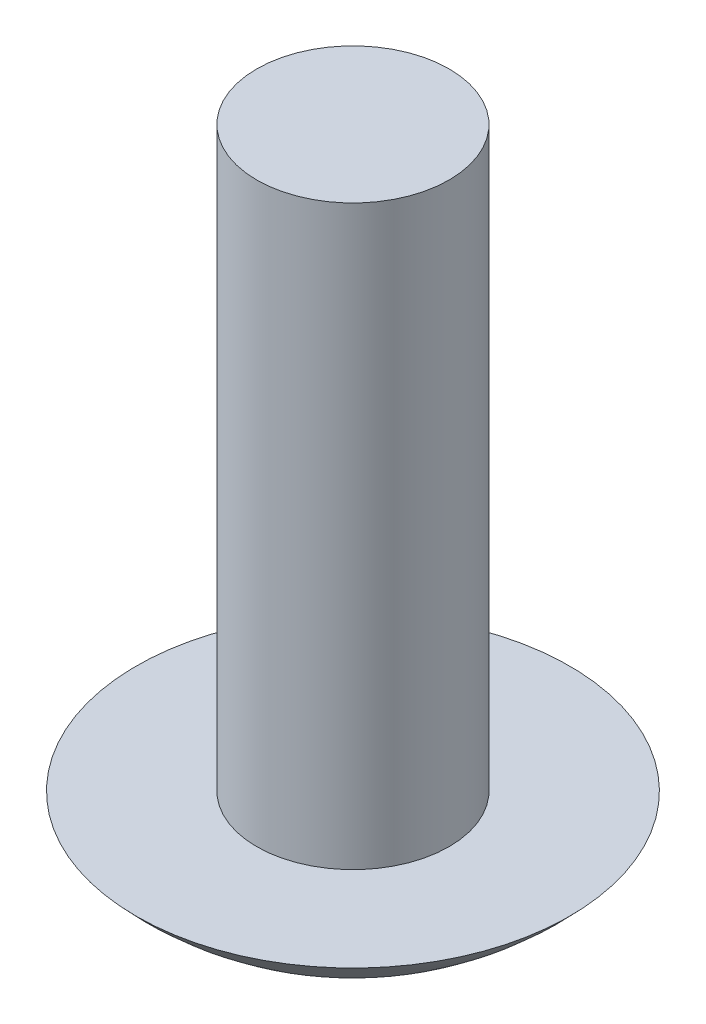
from build123d import *


with BuildPart() as part:
    # Sketch3 → Revolve1 (revolve)
    with BuildSketch(Plane(origin=(0, 0, 0), x_dir=(0, 0, -1), z_dir=(1, 0, 0))):
        with BuildLine():
            Line((0, 22.225), (0, 0))
            ThreePointArc((0, 0), (-3.911667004, 0.829438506), (-7.1501, 3.175))
            Line((-7.1501, 3.175), (-3.175, 3.175))
            Line((-3.175, 3.175), (-3.175, 22.225))
            Line((-3.175, 22.225), (0, 22.225))
        make_face()
    revolve(axis=Axis((0, 22.225, 0), (0, -1, 0)))


solid = part.part
